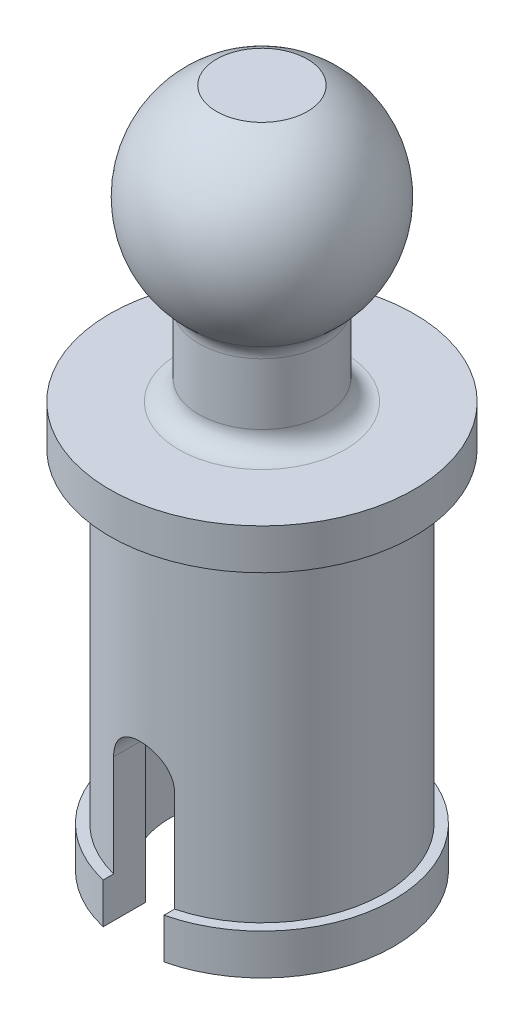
ISO-10303-21;
HEADER;
FILE_DESCRIPTION(('STEP AP214'),'2;1');
FILE_NAME('part.step','',(''),(''),'','','');
FILE_SCHEMA(('AUTOMOTIVE_DESIGN { 1 0 10303 214 1 1 1 1 }'));
ENDSEC;
DATA;
#1=APPLICATION_CONTEXT('core data for automotive mechanical design processes');
#2=APPLICATION_PROTOCOL_DEFINITION('international standard','automotive_design',2000,#1);
#3=PRODUCT_CONTEXT('',#1,'mechanical');
#4=PRODUCT('Part','Part','',(#3));
#5=PRODUCT_RELATED_PRODUCT_CATEGORY('part','',(#4));
#6=PRODUCT_DEFINITION_FORMATION('','',#4);
#7=PRODUCT_DEFINITION_CONTEXT('part definition',#1,'design');
#8=PRODUCT_DEFINITION('design','',#6,#7);
#9=PRODUCT_DEFINITION_SHAPE('','',#8);
#10=(LENGTH_UNIT() NAMED_UNIT(*) SI_UNIT(.MILLI.,.METRE.));
#11=(NAMED_UNIT(*) PLANE_ANGLE_UNIT() SI_UNIT($,.RADIAN.));
#12=(NAMED_UNIT(*) SI_UNIT($,.STERADIAN.) SOLID_ANGLE_UNIT());
#13=UNCERTAINTY_MEASURE_WITH_UNIT(LENGTH_MEASURE(1.E-05),#10,'distance_accuracy_value','');
#14=(GEOMETRIC_REPRESENTATION_CONTEXT(3) GLOBAL_UNCERTAINTY_ASSIGNED_CONTEXT((#13)) GLOBAL_UNIT_ASSIGNED_CONTEXT((#10,
#11,#12)) REPRESENTATION_CONTEXT('',''));
#15=CARTESIAN_POINT('',(0.,0.,0.));
#16=DIRECTION('',(0.,0.,1.));
#17=DIRECTION('',(1.,0.,0.));
#18=AXIS2_PLACEMENT_3D('',#15,#16,#17);
#19=CARTESIAN_POINT('',(-0.6,0.,-3.));
#20=DIRECTION('',(-1.,0.,0.));
#21=DIRECTION('',(0.,-1.,0.));
#22=AXIS2_PLACEMENT_3D('',#19,#20,#21);
#23=PLANE('',#22);
#24=DIRECTION('',(0.,0.,1.));
#25=VECTOR('',#24,1.);
#26=CARTESIAN_POINT('',(-0.6,2.8,-3.));
#27=LINE('',#26,#25);
#28=CARTESIAN_POINT('',(-0.6,2.8,-2.32379000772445));
#29=VERTEX_POINT('',#28);
#30=CARTESIAN_POINT('',(-0.6,2.8,-1.69705627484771));
#31=VERTEX_POINT('',#30);
#32=EDGE_CURVE('E253',#29,#31,#27,.T.);
#33=ORIENTED_EDGE('',*,*,#32,.T.);
#34=DIRECTION('',(0.,-1.,0.));
#35=VECTOR('',#34,1.);
#36=CARTESIAN_POINT('',(-0.599999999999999,7.2,-1.69705627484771));
#37=LINE('',#36,#35);
#38=CARTESIAN_POINT('',(-0.6,0.,-1.69705627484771));
#39=VERTEX_POINT('',#38);
#40=EDGE_CURVE('E235',#31,#39,#37,.T.);
#41=ORIENTED_EDGE('',*,*,#40,.T.);
#42=DIRECTION('',(0.,0.,1.));
#43=VECTOR('',#42,1.);
#44=CARTESIAN_POINT('',(-0.6,0.,-3.));
#45=LINE('',#44,#43);
#46=CARTESIAN_POINT('',(-0.6,0.,-2.5298221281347));
#47=VERTEX_POINT('',#46);
#48=EDGE_CURVE('E155',#47,#39,#45,.T.);
#49=ORIENTED_EDGE('',*,*,#48,.F.);
#50=DIRECTION('',(0.,1.,0.));
#51=VECTOR('',#50,1.);
#52=CARTESIAN_POINT('',(-0.599999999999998,16.8806956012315,-2.5298221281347));
#53=LINE('',#52,#51);
#54=CARTESIAN_POINT('',(-0.6,0.799999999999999,-2.5298221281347));
#55=VERTEX_POINT('',#54);
#56=EDGE_CURVE('E163',#55,#47,#53,.F.);
#57=ORIENTED_EDGE('',*,*,#56,.F.);
#58=DIRECTION('',(0.,0.,-1.));
#59=VECTOR('',#58,1.);
#60=CARTESIAN_POINT('',(-0.6,0.8,0.));
#61=LINE('',#60,#59);
#62=CARTESIAN_POINT('',(-0.599999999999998,0.799999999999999,-2.32379000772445));
#63=VERTEX_POINT('',#62);
#64=EDGE_CURVE('E160',#63,#55,#61,.T.);
#65=ORIENTED_EDGE('',*,*,#64,.F.);
#66=DIRECTION('',(0.,1.,0.));
#67=VECTOR('',#66,1.);
#68=CARTESIAN_POINT('',(-0.599999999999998,16.8806956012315,-2.32379000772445));
#69=LINE('',#68,#67);
#70=EDGE_CURVE('E130',#29,#63,#69,.F.);
#71=ORIENTED_EDGE('',*,*,#70,.F.);
#72=EDGE_LOOP('',(#33,#41,#49,#57,#65,#71));
#73=FACE_BOUND('',#72,.T.);
#74=ADVANCED_FACE('F33',(#73),#23,.F.);
#75=CARTESIAN_POINT('',(0.,2.8,-3.));
#76=DIRECTION('',(0.,0.,1.));
#77=DIRECTION('',(1.,0.,0.));
#78=AXIS2_PLACEMENT_3D('',#75,#76,#77);
#79=CYLINDRICAL_SURFACE('',#78,0.6);
#80=CARTESIAN_POINT('',(-0.6,2.8,1.69705627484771));
#81=VERTEX_POINT('',#80);
#82=CARTESIAN_POINT('',(-0.6,2.8,2.32379000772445));
#83=VERTEX_POINT('',#82);
#84=EDGE_CURVE('E255',#81,#83,#27,.T.);
#85=ORIENTED_EDGE('',*,*,#84,.F.);
#86=CARTESIAN_POINT('',(-0.6,2.8,1.69705627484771));
#87=CARTESIAN_POINT('',(-0.600032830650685,2.83275065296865,1.69701764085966));
#88=CARTESIAN_POINT('',(-0.59732093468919,2.86547046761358,1.69800343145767));
#89=CARTESIAN_POINT('',(-0.586676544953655,2.92984989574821,1.7017244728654));
#90=CARTESIAN_POINT('',(-0.578759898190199,2.96151242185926,1.70445441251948));
#91=CARTESIAN_POINT('',(-0.557977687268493,3.02297120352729,1.71136579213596));
#92=CARTESIAN_POINT('',(-0.545114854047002,3.05276847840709,1.71554643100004));
#93=CARTESIAN_POINT('',(-0.51484322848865,3.10980495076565,1.72487343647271));
#94=CARTESIAN_POINT('',(-0.497431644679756,3.13704256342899,1.73002039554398));
#95=CARTESIAN_POINT('',(-0.457831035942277,3.18923184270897,1.74092668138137));
#96=CARTESIAN_POINT('',(-0.435495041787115,3.21406884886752,1.74670121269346));
#97=CARTESIAN_POINT('',(-0.386993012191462,3.25972369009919,1.75808314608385));
#98=CARTESIAN_POINT('',(-0.360826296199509,3.28054080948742,1.76369051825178));
#99=CARTESIAN_POINT('',(-0.304562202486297,3.31808768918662,1.77428328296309));
#100=CARTESIAN_POINT('',(-0.274380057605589,3.33469658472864,1.77924862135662));
#101=CARTESIAN_POINT('',(-0.211457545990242,3.36255535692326,1.78781765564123));
#102=CARTESIAN_POINT('',(-0.178717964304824,3.37380687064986,1.79142176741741));
#103=CARTESIAN_POINT('',(-0.112817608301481,3.3902414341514,1.79675442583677));
#104=CARTESIAN_POINT('',(-0.0797111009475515,3.39562196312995,1.79854385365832));
#105=CARTESIAN_POINT('',(-0.0130193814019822,3.40078977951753,1.80026165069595));
#106=CARTESIAN_POINT('',(0.0205657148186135,3.40057839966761,1.80019046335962));
#107=CARTESIAN_POINT('',(0.085862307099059,3.3946934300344,1.7982362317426));
#108=CARTESIAN_POINT('',(0.117595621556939,3.38923441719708,1.79642436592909));
#109=CARTESIAN_POINT('',(0.179666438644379,3.37336408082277,1.79128176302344));
#110=CARTESIAN_POINT('',(0.210003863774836,3.36295248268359,1.78795094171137));
#111=CARTESIAN_POINT('',(0.268891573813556,3.33734717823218,1.78005400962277));
#112=CARTESIAN_POINT('',(0.297413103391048,3.3220923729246,1.77547222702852));
#113=CARTESIAN_POINT('',(0.351554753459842,3.28728402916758,1.76555032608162));
#114=CARTESIAN_POINT('',(0.377174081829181,3.26772932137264,1.76021000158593));
#115=CARTESIAN_POINT('',(0.426058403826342,3.22379737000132,1.74903763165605));
#116=CARTESIAN_POINT('',(0.449156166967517,3.19923667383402,1.74319427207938));
#117=CARTESIAN_POINT('',(0.490963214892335,3.14653510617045,1.73188494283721));
#118=CARTESIAN_POINT('',(0.509671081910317,3.1183930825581,1.72641909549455));
#119=CARTESIAN_POINT('',(0.542401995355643,3.05879189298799,1.71642018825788));
#120=CARTESIAN_POINT('',(0.556351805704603,3.02728989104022,1.7119020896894));
#121=CARTESIAN_POINT('',(0.578676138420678,2.96221181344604,1.70448658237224));
#122=CARTESIAN_POINT('',(0.587059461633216,2.92863910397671,1.70158661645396));
#123=CARTESIAN_POINT('',(0.594994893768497,2.87894881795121,1.69881925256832));
#124=CARTESIAN_POINT('',(0.596871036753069,2.86321516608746,1.69816000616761));
#125=CARTESIAN_POINT('',(0.599372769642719,2.83165715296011,1.69727822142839));
#126=CARTESIAN_POINT('',(0.599999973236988,2.81583293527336,1.69705511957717));
#127=CARTESIAN_POINT('',(0.6,2.8,1.69705627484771));
#128=B_SPLINE_CURVE_WITH_KNOTS('',3,(#86,#87,#88,#89,#90,#91,#92,#93,#94,#95,#96,#97,#98,#99,
#100,#101,#102,#103,#104,#105,#106,#107,#108,#109,#110,#111,#112,#113,#114,#115,#116,#117,#118,
#119,#120,#121,#122,#123,#124,#125,#126,#127),.UNSPECIFIED.,.F.,.F.,(4,2,2,2,2,2,2,2,2,2,2,2,2,
2,2,2,2,2,2,2,4),(0.,0.0980770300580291,0.195856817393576,0.293582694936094,0.391368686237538,
0.492607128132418,0.593863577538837,0.69776289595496,0.801630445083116,0.901884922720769,
1.00211550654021,1.09841460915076,1.19471905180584,1.29229021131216,1.38988793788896,
1.49207242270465,1.59428986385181,1.69801627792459,1.80157830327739,1.84910747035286,
1.89657518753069),.UNSPECIFIED.);
#129=CARTESIAN_POINT('',(0.599999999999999,2.8,1.69705627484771));
#130=VERTEX_POINT('',#129);
#131=EDGE_CURVE('E243',#81,#130,#128,.T.);
#132=ORIENTED_EDGE('',*,*,#131,.T.);
#133=DIRECTION('',(0.,0.,1.));
#134=VECTOR('',#133,1.);
#135=CARTESIAN_POINT('',(0.6,2.8,-3.));
#136=LINE('',#135,#134);
#137=CARTESIAN_POINT('',(0.6,2.8,2.32379000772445));
#138=VERTEX_POINT('',#137);
#139=EDGE_CURVE('E146',#130,#138,#136,.T.);
#140=ORIENTED_EDGE('',*,*,#139,.T.);
#141=CARTESIAN_POINT('',(-0.6,2.8,2.32379000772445));
#142=CARTESIAN_POINT('',(-0.600031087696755,2.83319369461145,2.32376171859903));
#143=CARTESIAN_POINT('',(-0.597247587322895,2.86636660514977,2.32450050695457));
#144=CARTESIAN_POINT('',(-0.586295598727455,2.93168786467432,2.3272975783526));
#145=CARTESIAN_POINT('',(-0.57813805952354,2.96383815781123,2.32935317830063));
#146=CARTESIAN_POINT('',(-0.556681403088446,3.02627052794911,2.33457057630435));
#147=CARTESIAN_POINT('',(-0.543382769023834,3.05655278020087,2.33773227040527));
#148=CARTESIAN_POINT('',(-0.512048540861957,3.11446801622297,2.34479533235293));
#149=CARTESIAN_POINT('',(-0.494011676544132,3.14210028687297,2.34869689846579));
#150=CARTESIAN_POINT('',(-0.453290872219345,3.19452601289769,2.35689742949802));
#151=CARTESIAN_POINT('',(-0.430522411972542,3.21925284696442,2.36120270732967));
#152=CARTESIAN_POINT('',(-0.381165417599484,3.26458133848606,2.36967066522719));
#153=CARTESIAN_POINT('',(-0.354576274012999,3.28518233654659,2.37383332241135));
#154=CARTESIAN_POINT('',(-0.297874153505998,3.3219465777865,2.38161708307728));
#155=CARTESIAN_POINT('',(-0.267717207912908,3.3380439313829,2.38522982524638));
#156=CARTESIAN_POINT('',(-0.205021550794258,3.36491484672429,2.39143408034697));
#157=CARTESIAN_POINT('',(-0.172483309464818,3.37568945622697,2.39402579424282));
#158=CARTESIAN_POINT('',(-0.106646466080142,3.39139539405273,2.39785139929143));
#159=CARTESIAN_POINT('',(-0.0733765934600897,3.39644060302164,2.39911171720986));
#160=CARTESIAN_POINT('',(-0.00643966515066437,3.40090202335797,2.40022462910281));
#161=CARTESIAN_POINT('',(0.0272273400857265,3.40031894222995,2.40007740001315));
#162=CARTESIAN_POINT('',(0.0932114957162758,3.39362202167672,2.3984114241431));
#163=CARTESIAN_POINT('',(0.12554202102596,3.38763123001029,2.39692319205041));
#164=CARTESIAN_POINT('',(0.188723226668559,3.37048679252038,2.39277798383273));
#165=CARTESIAN_POINT('',(0.219573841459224,3.35933291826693,2.39012095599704));
#166=CARTESIAN_POINT('',(0.279244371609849,3.33207923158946,2.38388998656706));
#167=CARTESIAN_POINT('',(0.308043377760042,3.31593556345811,2.38030796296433));
#168=CARTESIAN_POINT('',(0.362565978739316,3.27919412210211,2.37261567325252));
#169=CARTESIAN_POINT('',(0.388289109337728,3.25859567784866,2.36850532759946));
#170=CARTESIAN_POINT('',(0.43666163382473,3.2128726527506,2.36007339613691));
#171=CARTESIAN_POINT('',(0.459209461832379,3.18764101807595,2.35574910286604));
#172=CARTESIAN_POINT('',(0.49978174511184,3.13370207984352,2.34747700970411));
#173=CARTESIAN_POINT('',(0.517804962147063,3.10499382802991,2.34352931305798));
#174=CARTESIAN_POINT('',(0.548882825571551,3.0447126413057,2.33644688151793));
#175=CARTESIAN_POINT('',(0.561910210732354,3.01312512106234,2.33331663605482));
#176=CARTESIAN_POINT('',(0.582421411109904,2.94812984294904,2.32828235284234));
#177=CARTESIAN_POINT('',(0.58991351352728,2.9147248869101,2.32637648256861));
#178=CARTESIAN_POINT('',(0.596342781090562,2.86752557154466,2.32473174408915));
#179=CARTESIAN_POINT('',(0.597714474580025,2.85404817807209,2.32437913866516));
#180=CARTESIAN_POINT('',(0.599542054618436,2.82704932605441,2.32390837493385));
#181=CARTESIAN_POINT('',(0.599999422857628,2.81352797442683,2.32378983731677));
#182=CARTESIAN_POINT('',(0.6,2.8,2.32379000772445));
#183=B_SPLINE_CURVE_WITH_KNOTS('',3,(#141,#142,#143,#144,#145,#146,#147,#148,#149,#150,#151,
#152,#153,#154,#155,#156,#157,#158,#159,#160,#161,#162,#163,#164,#165,#166,#167,#168,#169,#170,
#171,#172,#173,#174,#175,#176,#177,#178,#179,#180,#181,#182),.UNSPECIFIED.,.F.,.F.,(4,2,2,2,2,2,
2,2,2,2,2,2,2,2,2,2,2,2,2,2,4),(0.,0.0994244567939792,0.198646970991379,0.297860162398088,
0.397099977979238,0.498294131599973,0.599504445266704,0.702126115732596,0.804727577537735,
0.905251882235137,1.00576355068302,1.10404426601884,1.20232932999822,1.30150404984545,
1.40069371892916,1.50255757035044,1.60444926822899,1.70688931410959,1.8091756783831,
1.84980408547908,1.89036659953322),.UNSPECIFIED.);
#184=EDGE_CURVE('E196',#83,#138,#183,.T.);
#185=ORIENTED_EDGE('',*,*,#184,.F.);
#186=EDGE_LOOP('',(#85,#132,#140,#185));
#187=FACE_BOUND('',#186,.T.);
#188=ADVANCED_FACE('F217',(#187),#79,.F.);
#189=CARTESIAN_POINT('',(0.6,2.8,-3.));
#190=DIRECTION('',(1.,0.,0.));
#191=DIRECTION('',(0.,1.,0.));
#192=AXIS2_PLACEMENT_3D('',#189,#190,#191);
#193=PLANE('',#192);
#194=ORIENTED_EDGE('',*,*,#139,.F.);
#195=DIRECTION('',(0.,-1.,0.));
#196=VECTOR('',#195,1.);
#197=CARTESIAN_POINT('',(0.599999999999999,7.2,1.69705627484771));
#198=LINE('',#197,#196);
#199=CARTESIAN_POINT('',(0.6,0.,1.69705627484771));
#200=VERTEX_POINT('',#199);
#201=EDGE_CURVE('E129',#130,#200,#198,.T.);
#202=ORIENTED_EDGE('',*,*,#201,.T.);
#203=DIRECTION('',(0.,0.,1.));
#204=VECTOR('',#203,1.);
#205=CARTESIAN_POINT('',(0.6,0.,-3.));
#206=LINE('',#205,#204);
#207=CARTESIAN_POINT('',(0.6,0.,2.5298221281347));
#208=VERTEX_POINT('',#207);
#209=EDGE_CURVE('E139',#200,#208,#206,.T.);
#210=ORIENTED_EDGE('',*,*,#209,.T.);
#211=DIRECTION('',(0.,1.,0.));
#212=VECTOR('',#211,1.);
#213=CARTESIAN_POINT('',(0.599999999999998,16.8806956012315,2.5298221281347));
#214=LINE('',#213,#212);
#215=CARTESIAN_POINT('',(0.6,0.799999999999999,2.5298221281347));
#216=VERTEX_POINT('',#215);
#217=EDGE_CURVE('E154',#216,#208,#214,.F.);
#218=ORIENTED_EDGE('',*,*,#217,.F.);
#219=DIRECTION('',(0.,0.,1.));
#220=VECTOR('',#219,1.);
#221=CARTESIAN_POINT('',(0.6,0.8,0.));
#222=LINE('',#221,#220);
#223=CARTESIAN_POINT('',(0.599999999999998,0.799999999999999,2.32379000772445));
#224=VERTEX_POINT('',#223);
#225=EDGE_CURVE('E56',#224,#216,#222,.T.);
#226=ORIENTED_EDGE('',*,*,#225,.F.);
#227=DIRECTION('',(0.,1.,0.));
#228=VECTOR('',#227,1.);
#229=CARTESIAN_POINT('',(0.599999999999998,16.8806956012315,2.32379000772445));
#230=LINE('',#229,#228);
#231=EDGE_CURVE('E194',#138,#224,#230,.F.);
#232=ORIENTED_EDGE('',*,*,#231,.F.);
#233=EDGE_LOOP('',(#194,#202,#210,#218,#226,#232));
#234=FACE_BOUND('',#233,.T.);
#235=ADVANCED_FACE('F318',(#234),#193,.F.);
#236=CARTESIAN_POINT('',(2.6,0.,0.));
#237=DIRECTION('',(0.,1.,0.));
#238=DIRECTION('',(-1.,0.,0.));
#239=AXIS2_PLACEMENT_3D('',#236,#237,#238);
#240=PLANE('',#239);
#241=ORIENTED_EDGE('',*,*,#48,.T.);
#242=CARTESIAN_POINT('',(0.,0.,0.));
#243=DIRECTION('',(0.,-1.,0.));
#244=DIRECTION('',(0.,0.,-1.));
#245=AXIS2_PLACEMENT_3D('',#242,#243,#244);
#246=CIRCLE('',#245,1.8);
#247=CARTESIAN_POINT('',(-0.6,0.,1.69705627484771));
#248=VERTEX_POINT('',#247);
#249=EDGE_CURVE('E141',#248,#39,#246,.T.);
#250=ORIENTED_EDGE('',*,*,#249,.F.);
#251=CARTESIAN_POINT('',(-0.6,0.,2.5298221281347));
#252=VERTEX_POINT('',#251);
#253=EDGE_CURVE('E252',#248,#252,#45,.T.);
#254=ORIENTED_EDGE('',*,*,#253,.T.);
#255=CARTESIAN_POINT('',(0.,0.,0.));
#256=DIRECTION('',(0.,1.,0.));
#257=DIRECTION('',(-1.,0.,0.));
#258=AXIS2_PLACEMENT_3D('',#255,#256,#257);
#259=CIRCLE('',#258,2.6);
#260=EDGE_CURVE('E190',#47,#252,#259,.T.);
#261=ORIENTED_EDGE('',*,*,#260,.F.);
#262=EDGE_LOOP('',(#241,#250,#254,#261));
#263=FACE_BOUND('',#262,.T.);
#264=ADVANCED_FACE('F283',(#263),#240,.F.);
#265=CARTESIAN_POINT('',(0.,16.8806956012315,0.));
#266=DIRECTION('',(0.,1.,0.));
#267=DIRECTION('',(-1.,0.,0.));
#268=AXIS2_PLACEMENT_3D('',#265,#266,#267);
#269=CYLINDRICAL_SURFACE('',#268,2.6);
#270=ORIENTED_EDGE('',*,*,#260,.T.);
#271=DIRECTION('',(0.,1.,0.));
#272=VECTOR('',#271,1.);
#273=CARTESIAN_POINT('',(-0.599999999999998,16.8806956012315,2.5298221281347));
#274=LINE('',#273,#272);
#275=CARTESIAN_POINT('',(-0.6,0.799999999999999,2.5298221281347));
#276=VERTEX_POINT('',#275);
#277=EDGE_CURVE('E167',#252,#276,#274,.T.);
#278=ORIENTED_EDGE('',*,*,#277,.T.);
#279=CARTESIAN_POINT('',(0.,0.799999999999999,0.));
#280=DIRECTION('',(0.,1.,0.));
#281=DIRECTION('',(-1.,0.,0.));
#282=AXIS2_PLACEMENT_3D('',#279,#280,#281);
#283=CIRCLE('',#282,2.6);
#284=EDGE_CURVE('E186',#55,#276,#283,.T.);
#285=ORIENTED_EDGE('',*,*,#284,.F.);
#286=ORIENTED_EDGE('',*,*,#56,.T.);
#287=EDGE_LOOP('',(#270,#278,#285,#286));
#288=FACE_BOUND('',#287,.T.);
#289=ADVANCED_FACE('F279',(#288),#269,.T.);
#290=CARTESIAN_POINT('',(2.4,0.8,0.));
#291=DIRECTION('',(0.,-1.,0.));
#292=DIRECTION('',(1.,0.,0.));
#293=AXIS2_PLACEMENT_3D('',#290,#291,#292);
#294=PLANE('',#293);
#295=ORIENTED_EDGE('',*,*,#284,.T.);
#296=CARTESIAN_POINT('',(-0.599999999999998,0.799999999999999,2.32379000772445));
#297=VERTEX_POINT('',#296);
#298=EDGE_CURVE('E164',#276,#297,#61,.T.);
#299=ORIENTED_EDGE('',*,*,#298,.T.);
#300=CARTESIAN_POINT('',(0.,0.799999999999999,0.));
#301=DIRECTION('',(0.,1.,0.));
#302=DIRECTION('',(-1.,0.,0.));
#303=AXIS2_PLACEMENT_3D('',#300,#301,#302);
#304=CIRCLE('',#303,2.4);
#305=EDGE_CURVE('E182',#63,#297,#304,.T.);
#306=ORIENTED_EDGE('',*,*,#305,.F.);
#307=ORIENTED_EDGE('',*,*,#64,.T.);
#308=EDGE_LOOP('',(#295,#299,#306,#307));
#309=FACE_BOUND('',#308,.T.);
#310=ADVANCED_FACE('F276',(#309),#294,.F.);
#311=ORIENTED_EDGE('',*,*,#209,.F.);
#312=CARTESIAN_POINT('',(0.6,0.,-1.69705627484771));
#313=VERTEX_POINT('',#312);
#314=EDGE_CURVE('E123',#313,#200,#246,.T.);
#315=ORIENTED_EDGE('',*,*,#314,.F.);
#316=CARTESIAN_POINT('',(0.6,0.,-2.5298221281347));
#317=VERTEX_POINT('',#316);
#318=EDGE_CURVE('E137',#317,#313,#206,.T.);
#319=ORIENTED_EDGE('',*,*,#318,.F.);
#320=EDGE_CURVE('E193',#208,#317,#259,.T.);
#321=ORIENTED_EDGE('',*,*,#320,.F.);
#322=EDGE_LOOP('',(#311,#315,#319,#321));
#323=FACE_BOUND('',#322,.T.);
#324=ADVANCED_FACE('F135',(#323),#240,.F.);
#325=ORIENTED_EDGE('',*,*,#320,.T.);
#326=DIRECTION('',(0.,1.,0.));
#327=VECTOR('',#326,1.);
#328=CARTESIAN_POINT('',(0.599999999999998,16.8806956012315,-2.5298221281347));
#329=LINE('',#328,#327);
#330=CARTESIAN_POINT('',(0.6,0.799999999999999,-2.5298221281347));
#331=VERTEX_POINT('',#330);
#332=EDGE_CURVE('E145',#317,#331,#329,.T.);
#333=ORIENTED_EDGE('',*,*,#332,.T.);
#334=EDGE_CURVE('E189',#216,#331,#283,.T.);
#335=ORIENTED_EDGE('',*,*,#334,.F.);
#336=ORIENTED_EDGE('',*,*,#217,.T.);
#337=EDGE_LOOP('',(#325,#333,#335,#336));
#338=FACE_BOUND('',#337,.T.);
#339=ADVANCED_FACE('F329',(#338),#269,.T.);
#340=ORIENTED_EDGE('',*,*,#334,.T.);
#341=CARTESIAN_POINT('',(0.599999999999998,0.799999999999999,-2.32379000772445));
#342=VERTEX_POINT('',#341);
#343=EDGE_CURVE('E156',#331,#342,#222,.T.);
#344=ORIENTED_EDGE('',*,*,#343,.T.);
#345=EDGE_CURVE('E185',#224,#342,#304,.T.);
#346=ORIENTED_EDGE('',*,*,#345,.F.);
#347=ORIENTED_EDGE('',*,*,#225,.T.);
#348=EDGE_LOOP('',(#340,#344,#346,#347));
#349=FACE_BOUND('',#348,.T.);
#350=ADVANCED_FACE('F326',(#349),#294,.F.);
#351=CARTESIAN_POINT('',(0.,16.8806956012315,0.));
#352=DIRECTION('',(0.,1.,0.));
#353=DIRECTION('',(-1.,0.,0.));
#354=AXIS2_PLACEMENT_3D('',#351,#352,#353);
#355=CYLINDRICAL_SURFACE('',#354,2.4);
#356=CARTESIAN_POINT('',(0.,7.2,0.));
#357=DIRECTION('',(0.,1.,0.));
#358=DIRECTION('',(-1.,0.,0.));
#359=AXIS2_PLACEMENT_3D('',#356,#357,#358);
#360=CIRCLE('',#359,2.4);
#361=CARTESIAN_POINT('',(-2.4,7.2,0.));
#362=VERTEX_POINT('',#361);
#363=EDGE_CURVE('E179',#362,#362,#360,.T.);
#364=ORIENTED_EDGE('',*,*,#363,.F.);
#365=EDGE_LOOP('',(#364));
#366=FACE_BOUND('',#365,.T.);
#367=CARTESIAN_POINT('',(0.6,2.8,-2.32379000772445));
#368=CARTESIAN_POINT('',(0.600031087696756,2.83319369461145,-2.32376171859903));
#369=CARTESIAN_POINT('',(0.597247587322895,2.86636660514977,-2.32450050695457));
#370=CARTESIAN_POINT('',(0.586295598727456,2.93168786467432,-2.3272975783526));
#371=CARTESIAN_POINT('',(0.578138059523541,2.96383815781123,-2.32935317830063));
#372=CARTESIAN_POINT('',(0.556681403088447,3.02627052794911,-2.33457057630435));
#373=CARTESIAN_POINT('',(0.543382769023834,3.05655278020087,-2.33773227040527));
#374=CARTESIAN_POINT('',(0.512048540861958,3.11446801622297,-2.34479533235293));
#375=CARTESIAN_POINT('',(0.494011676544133,3.14210028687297,-2.34869689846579));
#376=CARTESIAN_POINT('',(0.453290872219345,3.19452601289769,-2.35689742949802));
#377=CARTESIAN_POINT('',(0.430522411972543,3.21925284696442,-2.36120270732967));
#378=CARTESIAN_POINT('',(0.381165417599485,3.26458133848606,-2.36967066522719));
#379=CARTESIAN_POINT('',(0.354576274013,3.28518233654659,-2.37383332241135));
#380=CARTESIAN_POINT('',(0.297874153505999,3.3219465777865,-2.38161708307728));
#381=CARTESIAN_POINT('',(0.267717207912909,3.3380439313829,-2.38522982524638));
#382=CARTESIAN_POINT('',(0.205021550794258,3.36491484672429,-2.39143408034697));
#383=CARTESIAN_POINT('',(0.172483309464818,3.37568945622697,-2.39402579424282));
#384=CARTESIAN_POINT('',(0.106646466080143,3.39139539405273,-2.39785139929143));
#385=CARTESIAN_POINT('',(0.0733765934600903,3.39644060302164,-2.39911171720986));
#386=CARTESIAN_POINT('',(0.00643966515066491,3.40090202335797,-2.40022462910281));
#387=CARTESIAN_POINT('',(-0.027227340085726,3.40031894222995,-2.40007740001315));
#388=CARTESIAN_POINT('',(-0.0932114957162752,3.39362202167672,-2.3984114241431));
#389=CARTESIAN_POINT('',(-0.125542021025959,3.38763123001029,-2.39692319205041));
#390=CARTESIAN_POINT('',(-0.188723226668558,3.37048679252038,-2.39277798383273));
#391=CARTESIAN_POINT('',(-0.219573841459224,3.35933291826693,-2.39012095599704));
#392=CARTESIAN_POINT('',(-0.279244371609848,3.33207923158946,-2.38388998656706));
#393=CARTESIAN_POINT('',(-0.308043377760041,3.31593556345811,-2.38030796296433));
#394=CARTESIAN_POINT('',(-0.362565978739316,3.27919412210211,-2.37261567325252));
#395=CARTESIAN_POINT('',(-0.388289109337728,3.25859567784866,-2.36850532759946));
#396=CARTESIAN_POINT('',(-0.43666163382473,3.2128726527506,-2.36007339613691));
#397=CARTESIAN_POINT('',(-0.459209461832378,3.18764101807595,-2.35574910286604));
#398=CARTESIAN_POINT('',(-0.49978174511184,3.13370207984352,-2.34747700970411));
#399=CARTESIAN_POINT('',(-0.517804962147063,3.10499382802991,-2.34352931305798));
#400=CARTESIAN_POINT('',(-0.54888282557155,3.0447126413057,-2.33644688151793));
#401=CARTESIAN_POINT('',(-0.561910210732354,3.01312512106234,-2.33331663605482));
#402=CARTESIAN_POINT('',(-0.582421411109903,2.94812984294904,-2.32828235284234));
#403=CARTESIAN_POINT('',(-0.589913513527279,2.9147248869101,-2.32637648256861));
#404=CARTESIAN_POINT('',(-0.596342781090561,2.86752557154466,-2.32473174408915));
#405=CARTESIAN_POINT('',(-0.597714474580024,2.85404817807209,-2.32437913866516));
#406=CARTESIAN_POINT('',(-0.599542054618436,2.82704932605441,-2.32390837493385));
#407=CARTESIAN_POINT('',(-0.599999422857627,2.81352797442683,-2.32378983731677));
#408=CARTESIAN_POINT('',(-0.6,2.8,-2.32379000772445));
#409=B_SPLINE_CURVE_WITH_KNOTS('',3,(#367,#368,#369,#370,#371,#372,#373,#374,#375,#376,#377,
#378,#379,#380,#381,#382,#383,#384,#385,#386,#387,#388,#389,#390,#391,#392,#393,#394,#395,#396,
#397,#398,#399,#400,#401,#402,#403,#404,#405,#406,#407,#408),.UNSPECIFIED.,.F.,.F.,(4,2,2,2,2,2,
2,2,2,2,2,2,2,2,2,2,2,2,2,2,4),(0.,0.0994244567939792,0.198646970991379,0.297860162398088,
0.397099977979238,0.498294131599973,0.599504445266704,0.702126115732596,0.804727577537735,
0.905251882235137,1.00576355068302,1.10404426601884,1.20232932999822,1.30150404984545,
1.40069371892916,1.50255757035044,1.60444926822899,1.70688931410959,1.8091756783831,
1.84980408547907,1.89036659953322),.UNSPECIFIED.);
#410=CARTESIAN_POINT('',(0.6,2.8,-2.32379000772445));
#411=VERTEX_POINT('',#410);
#412=EDGE_CURVE('E225',#411,#29,#409,.T.);
#413=ORIENTED_EDGE('',*,*,#412,.T.);
#414=ORIENTED_EDGE('',*,*,#70,.T.);
#415=ORIENTED_EDGE('',*,*,#305,.T.);
#416=DIRECTION('',(0.,1.,0.));
#417=VECTOR('',#416,1.);
#418=CARTESIAN_POINT('',(-0.599999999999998,16.8806956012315,2.32379000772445));
#419=LINE('',#418,#417);
#420=EDGE_CURVE('E204',#297,#83,#419,.T.);
#421=ORIENTED_EDGE('',*,*,#420,.T.);
#422=ORIENTED_EDGE('',*,*,#184,.T.);
#423=ORIENTED_EDGE('',*,*,#231,.T.);
#424=ORIENTED_EDGE('',*,*,#345,.T.);
#425=DIRECTION('',(0.,1.,0.));
#426=VECTOR('',#425,1.);
#427=CARTESIAN_POINT('',(0.599999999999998,16.8806956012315,-2.32379000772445));
#428=LINE('',#427,#426);
#429=EDGE_CURVE('E264',#342,#411,#428,.T.);
#430=ORIENTED_EDGE('',*,*,#429,.T.);
#431=EDGE_LOOP('',(#413,#414,#415,#421,#422,#423,#424,#430));
#432=FACE_BOUND('',#431,.T.);
#433=ADVANCED_FACE('F206',(#366,#432),#355,.T.);
#434=CARTESIAN_POINT('',(3.,7.2,0.));
#435=DIRECTION('',(0.,1.,0.));
#436=DIRECTION('',(-1.,0.,0.));
#437=AXIS2_PLACEMENT_3D('',#434,#435,#436);
#438=PLANE('',#437);
#439=CARTESIAN_POINT('',(0.,7.2,0.));
#440=DIRECTION('',(0.,1.,0.));
#441=DIRECTION('',(-1.,0.,0.));
#442=AXIS2_PLACEMENT_3D('',#439,#440,#441);
#443=CIRCLE('',#442,3.);
#444=CARTESIAN_POINT('',(-3.,7.2,0.));
#445=VERTEX_POINT('',#444);
#446=EDGE_CURVE('E176',#445,#445,#443,.T.);
#447=ORIENTED_EDGE('',*,*,#446,.F.);
#448=EDGE_LOOP('',(#447));
#449=FACE_BOUND('',#448,.T.);
#450=ORIENTED_EDGE('',*,*,#363,.T.);
#451=EDGE_LOOP('',(#450));
#452=FACE_BOUND('',#451,.T.);
#453=ADVANCED_FACE('F368',(#449,#452),#438,.F.);
#454=CARTESIAN_POINT('',(0.,16.8806956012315,0.));
#455=DIRECTION('',(0.,1.,0.));
#456=DIRECTION('',(-1.,0.,0.));
#457=AXIS2_PLACEMENT_3D('',#454,#455,#456);
#458=CYLINDRICAL_SURFACE('',#457,3.);
#459=CARTESIAN_POINT('',(0.,8.,0.));
#460=DIRECTION('',(0.,1.,0.));
#461=DIRECTION('',(-1.,0.,0.));
#462=AXIS2_PLACEMENT_3D('',#459,#460,#461);
#463=CIRCLE('',#462,3.);
#464=CARTESIAN_POINT('',(-3.,8.,0.));
#465=VERTEX_POINT('',#464);
#466=EDGE_CURVE('E173',#465,#465,#463,.T.);
#467=ORIENTED_EDGE('',*,*,#466,.F.);
#468=EDGE_LOOP('',(#467));
#469=FACE_BOUND('',#468,.T.);
#470=ORIENTED_EDGE('',*,*,#446,.T.);
#471=EDGE_LOOP('',(#470));
#472=FACE_BOUND('',#471,.T.);
#473=ADVANCED_FACE('F401',(#469,#472),#458,.T.);
#474=CARTESIAN_POINT('',(1.24,8.,0.));
#475=DIRECTION('',(0.,-1.,0.));
#476=DIRECTION('',(1.,0.,0.));
#477=AXIS2_PLACEMENT_3D('',#474,#475,#476);
#478=PLANE('',#477);
#479=CARTESIAN_POINT('',(0.,8.,0.));
#480=DIRECTION('',(0.,-1.,0.));
#481=DIRECTION('',(1.,0.,0.));
#482=AXIS2_PLACEMENT_3D('',#479,#480,#481);
#483=CIRCLE('',#482,1.64);
#484=CARTESIAN_POINT('',(1.64,8.,0.));
#485=VERTEX_POINT('',#484);
#486=EDGE_CURVE('E11',#485,#485,#483,.T.);
#487=ORIENTED_EDGE('',*,*,#486,.T.);
#488=EDGE_LOOP('',(#487));
#489=FACE_BOUND('',#488,.T.);
#490=ORIENTED_EDGE('',*,*,#466,.T.);
#491=EDGE_LOOP('',(#490));
#492=FACE_BOUND('',#491,.T.);
#493=ADVANCED_FACE('F406',(#489,#492),#478,.F.);
#494=CARTESIAN_POINT('',(0.,16.8806956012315,0.));
#495=DIRECTION('',(0.,1.,0.));
#496=DIRECTION('',(-1.,0.,0.));
#497=AXIS2_PLACEMENT_3D('',#494,#495,#496);
#498=CYLINDRICAL_SURFACE('',#497,1.24);
#499=CARTESIAN_POINT('',(0.,9.60771481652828,0.));
#500=DIRECTION('',(0.,1.,0.));
#501=DIRECTION('',(-1.,0.,0.));
#502=AXIS2_PLACEMENT_3D('',#499,#500,#501);
#503=CIRCLE('',#502,1.24);
#504=CARTESIAN_POINT('',(-1.24,9.60771481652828,0.));
#505=VERTEX_POINT('',#504);
#506=EDGE_CURVE('E41',#505,#505,#503,.F.);
#507=ORIENTED_EDGE('',*,*,#506,.T.);
#508=EDGE_LOOP('',(#507));
#509=FACE_BOUND('',#508,.T.);
#510=CARTESIAN_POINT('',(0.,8.4,0.));
#511=DIRECTION('',(0.,-1.,0.));
#512=DIRECTION('',(1.,0.,0.));
#513=AXIS2_PLACEMENT_3D('',#510,#511,#512);
#514=CIRCLE('',#513,1.24);
#515=CARTESIAN_POINT('',(1.24,8.4,0.));
#516=VERTEX_POINT('',#515);
#517=EDGE_CURVE('E289',#516,#516,#514,.F.);
#518=ORIENTED_EDGE('',*,*,#517,.T.);
#519=EDGE_LOOP('',(#518));
#520=FACE_BOUND('',#519,.T.);
#521=ADVANCED_FACE('F294',(#509,#520),#498,.T.);
#522=CARTESIAN_POINT('',(0.,11.4976842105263,0.));
#523=DIRECTION('',(0.,1.,0.));
#524=DIRECTION('',(1.,0.,0.));
#525=AXIS2_PLACEMENT_3D('',#522,#523,#524);
#526=SPHERICAL_SURFACE('',#525,2.10231578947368);
#527=CARTESIAN_POINT('',(0.,9.90983006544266,0.));
#528=DIRECTION('',(0.,1.,0.));
#529=DIRECTION('',(-1.,0.,0.));
#530=AXIS2_PLACEMENT_3D('',#527,#528,#529);
#531=CIRCLE('',#530,1.37784284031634);
#532=CARTESIAN_POINT('',(1.37784284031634,9.90983006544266,0.));
#533=VERTEX_POINT('',#532);
#534=EDGE_CURVE('E286',#533,#533,#531,.T.);
#535=CARTESIAN_POINT('',(0.,13.4,0.));
#536=DIRECTION('',(0.,1.,0.));
#537=DIRECTION('',(-1.,0.,0.));
#538=AXIS2_PLACEMENT_3D('',#535,#536,#537);
#539=CIRCLE('',#538,0.894944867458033);
#540=CARTESIAN_POINT('',(0.894944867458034,13.4,0.));
#541=VERTEX_POINT('',#540);
#542=EDGE_CURVE('E170',#541,#541,#539,.T.);
#543=CARTESIAN_POINT('',(1.37784284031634,9.90983006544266,0.));
#544=CARTESIAN_POINT('',(1.41071207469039,9.93834950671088,0.));
#545=CARTESIAN_POINT('',(1.44269320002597,9.96789211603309,0.));
#546=CARTESIAN_POINT('',(1.50476170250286,10.0289039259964,0.));
#547=CARTESIAN_POINT('',(1.53484907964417,10.0603731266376,0.));
#548=CARTESIAN_POINT('',(1.59301255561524,10.1251183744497,0.));
#549=CARTESIAN_POINT('',(1.62108865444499,10.1583944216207,0.));
#550=CARTESIAN_POINT('',(1.67512175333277,10.2266246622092,0.));
#551=CARTESIAN_POINT('',(1.70107875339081,10.2615788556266,0.));
#552=CARTESIAN_POINT('',(1.75077347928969,10.3330307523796,0.));
#553=CARTESIAN_POINT('',(1.77451120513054,10.3695284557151,0.));
#554=CARTESIAN_POINT('',(1.81967590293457,10.4439266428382,0.));
#555=CARTESIAN_POINT('',(1.84110287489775,10.4818271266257,0.));
#556=CARTESIAN_POINT('',(1.88156345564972,10.5588847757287,0.));
#557=CARTESIAN_POINT('',(1.9005970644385,10.5980419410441,0.));
#558=CARTESIAN_POINT('',(1.93619754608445,10.6774619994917,0.));
#559=CARTESIAN_POINT('',(1.95276441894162,10.7177248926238,0.));
#560=CARTESIAN_POINT('',(1.98336756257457,10.7992011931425,0.));
#561=CARTESIAN_POINT('',(1.99740383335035,10.8404146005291,0.));
#562=CARTESIAN_POINT('',(2.02289166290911,10.9236330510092,0.));
#563=CARTESIAN_POINT('',(2.03434322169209,10.9656380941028,0.));
#564=CARTESIAN_POINT('',(2.05461748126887,11.0502778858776,0.));
#565=CARTESIAN_POINT('',(2.06344018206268,11.0929126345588,0.));
#566=CARTESIAN_POINT('',(2.07842271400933,11.1786474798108,0.));
#567=CARTESIAN_POINT('',(2.08458254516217,11.2217475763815,0.));
#568=CARTESIAN_POINT('',(2.09421559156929,11.3082469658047,0.));
#569=CARTESIAN_POINT('',(2.09768880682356,11.3516462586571,0.));
#570=CARTESIAN_POINT('',(2.10193523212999,11.438576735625,0.));
#571=CARTESIAN_POINT('',(2.10270844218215,11.4821079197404,0.));
#572=CARTESIAN_POINT('',(2.10155187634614,11.5691343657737,0.));
#573=CARTESIAN_POINT('',(2.09962210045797,11.6126296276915,0.));
#574=CARTESIAN_POINT('',(2.09306700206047,11.6994165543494,0.));
#575=CARTESIAN_POINT('',(2.08844167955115,11.7427082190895,0.));
#576=CARTESIAN_POINT('',(2.07651331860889,11.8289210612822,0.));
#577=CARTESIAN_POINT('',(2.06921028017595,11.8718422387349,0.));
#578=CARTESIAN_POINT('',(2.05195464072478,11.9571486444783,0.));
#579=CARTESIAN_POINT('',(2.04200203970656,11.999533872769,0.));
#580=CARTESIAN_POINT('',(2.0194856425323,12.0836049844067,0.));
#581=CARTESIAN_POINT('',(2.00692184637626,12.1252908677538,0.));
#582=CARTESIAN_POINT('',(1.97923149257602,12.2078025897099,0.));
#583=CARTESIAN_POINT('',(1.96410493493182,12.2486284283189,0.));
#584=CARTESIAN_POINT('',(1.93134737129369,12.3292626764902,0.));
#585=CARTESIAN_POINT('',(1.91371636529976,12.3690710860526,0.));
#586=CARTESIAN_POINT('',(1.87601787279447,12.4475170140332,0.));
#587=CARTESIAN_POINT('',(1.85595038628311,12.4861545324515,0.));
#588=CARTESIAN_POINT('',(1.81345629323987,12.5621097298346,0.));
#589=CARTESIAN_POINT('',(1.79102968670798,12.5994274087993,0.));
#590=CARTESIAN_POINT('',(1.74390380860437,12.6725990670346,0.));
#591=CARTESIAN_POINT('',(1.71920453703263,12.7084530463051,0.));
#592=CARTESIAN_POINT('',(1.66762854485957,12.7785590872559,0.));
#593=CARTESIAN_POINT('',(1.64075182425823,12.8128111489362,0.));
#594=CARTESIAN_POINT('',(1.58492454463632,12.8795813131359,0.));
#595=CARTESIAN_POINT('',(1.55597398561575,12.9120994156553,0.));
#596=CARTESIAN_POINT('',(1.49611063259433,12.9752763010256,0.));
#597=CARTESIAN_POINT('',(1.4651978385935,13.0059350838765,0.));
#598=CARTESIAN_POINT('',(1.40152919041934,13.0652751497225,0.));
#599=CARTESIAN_POINT('',(1.36877333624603,13.0939564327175,0.));
#600=CARTESIAN_POINT('',(1.30154482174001,13.1492308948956,0.));
#601=CARTESIAN_POINT('',(1.2670721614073,13.1758240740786,0.));
#602=CARTESIAN_POINT('',(1.1965430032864,13.2268199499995,0.));
#603=CARTESIAN_POINT('',(1.1604865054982,13.2512226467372,0.));
#604=CARTESIAN_POINT('',(1.08692838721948,13.2977429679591,0.));
#605=CARTESIAN_POINT('',(1.04942676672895,13.3198605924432,0.));
#606=CARTESIAN_POINT('',(0.973124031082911,13.3617274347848,0.));
#607=CARTESIAN_POINT('',(0.934322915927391,13.3814766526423,0.));
#608=CARTESIAN_POINT('',(0.894944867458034,13.4,0.));
#609=B_SPLINE_CURVE_WITH_KNOTS('',3,(#543,#544,#545,#546,#547,#548,#549,#550,#551,#552,#553,
#554,#555,#556,#557,#558,#559,#560,#561,#562,#563,#564,#565,#566,#567,#568,#569,#570,#571,#572,
#573,#574,#575,#576,#577,#578,#579,#580,#581,#582,#583,#584,#585,#586,#587,#588,#589,#590,#591,
#592,#593,#594,#595,#596,#597,#598,#599,#600,#601,#602,#603,#604,#605,#606,#607,#608),
.UNSPECIFIED.,.F.,.F.,(4,2,2,2,2,2,2,2,2,2,2,2,2,2,2,2,2,2,2,2,2,2,2,2,2,2,2,2,2,2,2,2,4),(0.,
0.130530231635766,0.261060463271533,0.3915906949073,0.522120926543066,0.652651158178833,
0.7831813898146,0.913711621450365,1.04424185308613,1.1747720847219,1.30530231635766,
1.43583254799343,1.5663627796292,1.69689301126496,1.82742324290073,1.9579534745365,
2.08848370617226,2.21901393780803,2.3495441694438,2.48007440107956,2.61060463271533,
2.7411348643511,2.87166509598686,3.00219532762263,3.1327255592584,3.26325579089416,
3.39378602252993,3.5243162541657,3.65484648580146,3.78537671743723,3.915906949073,
4.04643718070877,4.17696741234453),.UNSPECIFIED.);
#610=EDGE_CURVE('BSEAM302',#533,#541,#609,.T.);
#611=ORIENTED_EDGE('',*,*,#534,.T.);
#612=ORIENTED_EDGE('',*,*,#542,.F.);
#613=ORIENTED_EDGE('',*,*,#610,.T.);
#614=ORIENTED_EDGE('',*,*,#610,.F.);
#615=EDGE_LOOP('',(#611,#613,#612,#614));
#616=FACE_BOUND('',#615,.T.);
#617=ADVANCED_FACE('F302',(#616),#526,.T.);
#618=CARTESIAN_POINT('',(0.,13.4,0.));
#619=DIRECTION('',(0.,-1.,0.));
#620=DIRECTION('',(1.,0.,0.));
#621=AXIS2_PLACEMENT_3D('',#618,#619,#620);
#622=PLANE('',#621);
#623=ORIENTED_EDGE('',*,*,#542,.T.);
#624=EDGE_LOOP('',(#623));
#625=FACE_BOUND('',#624,.T.);
#626=ADVANCED_FACE('F305',(#625),#622,.F.);
#627=ORIENTED_EDGE('',*,*,#253,.F.);
#628=DIRECTION('',(0.,-1.,0.));
#629=VECTOR('',#628,1.);
#630=CARTESIAN_POINT('',(-0.599999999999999,7.2,1.69705627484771));
#631=LINE('',#630,#629);
#632=EDGE_CURVE('E150',#248,#81,#631,.F.);
#633=ORIENTED_EDGE('',*,*,#632,.T.);
#634=ORIENTED_EDGE('',*,*,#84,.T.);
#635=ORIENTED_EDGE('',*,*,#420,.F.);
#636=ORIENTED_EDGE('',*,*,#298,.F.);
#637=ORIENTED_EDGE('',*,*,#277,.F.);
#638=EDGE_LOOP('',(#627,#633,#634,#635,#636,#637));
#639=FACE_BOUND('',#638,.T.);
#640=ADVANCED_FACE('F215',(#639),#23,.F.);
#641=CARTESIAN_POINT('',(0.6,2.8,-1.69705627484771));
#642=VERTEX_POINT('',#641);
#643=EDGE_CURVE('E148',#411,#642,#136,.T.);
#644=ORIENTED_EDGE('',*,*,#643,.T.);
#645=CARTESIAN_POINT('',(0.6,2.8,-1.69705627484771));
#646=CARTESIAN_POINT('',(0.600032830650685,2.83275065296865,-1.69701764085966));
#647=CARTESIAN_POINT('',(0.59732093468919,2.86547046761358,-1.69800343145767));
#648=CARTESIAN_POINT('',(0.586676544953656,2.92984989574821,-1.7017244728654));
#649=CARTESIAN_POINT('',(0.5787598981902,2.96151242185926,-1.70445441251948));
#650=CARTESIAN_POINT('',(0.557977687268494,3.02297120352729,-1.71136579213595));
#651=CARTESIAN_POINT('',(0.545114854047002,3.05276847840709,-1.71554643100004));
#652=CARTESIAN_POINT('',(0.514843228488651,3.10980495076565,-1.72487343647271));
#653=CARTESIAN_POINT('',(0.497431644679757,3.13704256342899,-1.73002039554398));
#654=CARTESIAN_POINT('',(0.457831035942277,3.18923184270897,-1.74092668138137));
#655=CARTESIAN_POINT('',(0.435495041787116,3.21406884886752,-1.74670121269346));
#656=CARTESIAN_POINT('',(0.386993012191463,3.25972369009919,-1.75808314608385));
#657=CARTESIAN_POINT('',(0.36082629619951,3.28054080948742,-1.76369051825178));
#658=CARTESIAN_POINT('',(0.304562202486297,3.31808768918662,-1.77428328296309));
#659=CARTESIAN_POINT('',(0.27438005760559,3.33469658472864,-1.77924862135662));
#660=CARTESIAN_POINT('',(0.211457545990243,3.36255535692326,-1.78781765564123));
#661=CARTESIAN_POINT('',(0.178717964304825,3.37380687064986,-1.79142176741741));
#662=CARTESIAN_POINT('',(0.112817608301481,3.3902414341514,-1.79675442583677));
#663=CARTESIAN_POINT('',(0.079711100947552,3.39562196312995,-1.79854385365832));
#664=CARTESIAN_POINT('',(0.0130193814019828,3.40078977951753,-1.80026165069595));
#665=CARTESIAN_POINT('',(-0.0205657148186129,3.40057839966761,-1.80019046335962));
#666=CARTESIAN_POINT('',(-0.0858623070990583,3.3946934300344,-1.7982362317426));
#667=CARTESIAN_POINT('',(-0.117595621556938,3.38923441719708,-1.79642436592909));
#668=CARTESIAN_POINT('',(-0.179666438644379,3.37336408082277,-1.79128176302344));
#669=CARTESIAN_POINT('',(-0.210003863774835,3.36295248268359,-1.78795094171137));
#670=CARTESIAN_POINT('',(-0.268891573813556,3.33734717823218,-1.78005400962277));
#671=CARTESIAN_POINT('',(-0.297413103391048,3.3220923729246,-1.77547222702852));
#672=CARTESIAN_POINT('',(-0.351554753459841,3.28728402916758,-1.76555032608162));
#673=CARTESIAN_POINT('',(-0.37717408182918,3.26772932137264,-1.76021000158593));
#674=CARTESIAN_POINT('',(-0.426058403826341,3.22379737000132,-1.74903763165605));
#675=CARTESIAN_POINT('',(-0.449156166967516,3.19923667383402,-1.74319427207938));
#676=CARTESIAN_POINT('',(-0.490963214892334,3.14653510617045,-1.73188494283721));
#677=CARTESIAN_POINT('',(-0.509671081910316,3.1183930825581,-1.72641909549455));
#678=CARTESIAN_POINT('',(-0.542401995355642,3.05879189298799,-1.71642018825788));
#679=CARTESIAN_POINT('',(-0.556351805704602,3.02728989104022,-1.7119020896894));
#680=CARTESIAN_POINT('',(-0.578676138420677,2.96221181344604,-1.70448658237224));
#681=CARTESIAN_POINT('',(-0.587059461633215,2.92863910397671,-1.70158661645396));
#682=CARTESIAN_POINT('',(-0.594994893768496,2.87894881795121,-1.69881925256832));
#683=CARTESIAN_POINT('',(-0.596871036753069,2.86321516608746,-1.69816000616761));
#684=CARTESIAN_POINT('',(-0.599372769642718,2.83165715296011,-1.69727822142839));
#685=CARTESIAN_POINT('',(-0.599999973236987,2.81583293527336,-1.69705511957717));
#686=CARTESIAN_POINT('',(-0.6,2.8,-1.69705627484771));
#687=B_SPLINE_CURVE_WITH_KNOTS('',3,(#645,#646,#647,#648,#649,#650,#651,#652,#653,#654,#655,
#656,#657,#658,#659,#660,#661,#662,#663,#664,#665,#666,#667,#668,#669,#670,#671,#672,#673,#674,
#675,#676,#677,#678,#679,#680,#681,#682,#683,#684,#685,#686),.UNSPECIFIED.,.F.,.F.,(4,2,2,2,2,2,
2,2,2,2,2,2,2,2,2,2,2,2,2,2,4),(0.,0.0980770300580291,0.195856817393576,0.293582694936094,
0.391368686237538,0.492607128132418,0.593863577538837,0.69776289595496,0.801630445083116,
0.90188492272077,1.00211550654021,1.09841460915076,1.19471905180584,1.29229021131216,
1.38988793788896,1.49207242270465,1.59428986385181,1.69801627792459,1.80157830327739,
1.84910747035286,1.89657518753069),.UNSPECIFIED.);
#688=EDGE_CURVE('E48',#642,#31,#687,.T.);
#689=ORIENTED_EDGE('',*,*,#688,.T.);
#690=ORIENTED_EDGE('',*,*,#32,.F.);
#691=ORIENTED_EDGE('',*,*,#412,.F.);
#692=EDGE_LOOP('',(#644,#689,#690,#691));
#693=FACE_BOUND('',#692,.T.);
#694=ADVANCED_FACE('F210',(#693),#79,.F.);
#695=ORIENTED_EDGE('',*,*,#318,.T.);
#696=DIRECTION('',(0.,-1.,0.));
#697=VECTOR('',#696,1.);
#698=CARTESIAN_POINT('',(0.599999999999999,7.2,-1.69705627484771));
#699=LINE('',#698,#697);
#700=EDGE_CURVE('E120',#313,#642,#699,.F.);
#701=ORIENTED_EDGE('',*,*,#700,.T.);
#702=ORIENTED_EDGE('',*,*,#643,.F.);
#703=ORIENTED_EDGE('',*,*,#429,.F.);
#704=ORIENTED_EDGE('',*,*,#343,.F.);
#705=ORIENTED_EDGE('',*,*,#332,.F.);
#706=EDGE_LOOP('',(#695,#701,#702,#703,#704,#705));
#707=FACE_BOUND('',#706,.T.);
#708=ADVANCED_FACE('F143',(#707),#193,.F.);
#709=CARTESIAN_POINT('',(0.,7.2,0.));
#710=DIRECTION('',(0.,-1.,0.));
#711=DIRECTION('',(0.,0.,-1.));
#712=AXIS2_PLACEMENT_3D('',#709,#710,#711);
#713=CYLINDRICAL_SURFACE('',#712,1.8);
#714=CARTESIAN_POINT('',(0.,7.2,0.));
#715=DIRECTION('',(0.,-1.,0.));
#716=DIRECTION('',(0.,0.,-1.));
#717=AXIS2_PLACEMENT_3D('',#714,#715,#716);
#718=CIRCLE('',#717,1.8);
#719=CARTESIAN_POINT('',(0.,7.2,-1.8));
#720=VERTEX_POINT('',#719);
#721=EDGE_CURVE('E140',#720,#720,#718,.T.);
#722=ORIENTED_EDGE('',*,*,#721,.F.);
#723=EDGE_LOOP('',(#722));
#724=FACE_BOUND('',#723,.T.);
#725=ORIENTED_EDGE('',*,*,#249,.T.);
#726=ORIENTED_EDGE('',*,*,#40,.F.);
#727=ORIENTED_EDGE('',*,*,#688,.F.);
#728=ORIENTED_EDGE('',*,*,#700,.F.);
#729=ORIENTED_EDGE('',*,*,#314,.T.);
#730=ORIENTED_EDGE('',*,*,#201,.F.);
#731=ORIENTED_EDGE('',*,*,#131,.F.);
#732=ORIENTED_EDGE('',*,*,#632,.F.);
#733=EDGE_LOOP('',(#725,#726,#727,#728,#729,#730,#731,#732));
#734=FACE_BOUND('',#733,.T.);
#735=ADVANCED_FACE('F122',(#724,#734),#713,.F.);
#736=CARTESIAN_POINT('',(0.,7.2,0.));
#737=DIRECTION('',(0.,-1.,0.));
#738=DIRECTION('',(0.,0.,-1.));
#739=AXIS2_PLACEMENT_3D('',#736,#737,#738);
#740=PLANE('',#739);
#741=ORIENTED_EDGE('',*,*,#721,.T.);
#742=EDGE_LOOP('',(#741));
#743=FACE_BOUND('',#742,.T.);
#744=ADVANCED_FACE('F240',(#743),#740,.T.);
#745=CARTESIAN_POINT('',(0.,9.60771481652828,0.));
#746=DIRECTION('',(0.,1.,0.));
#747=DIRECTION('',(-1.,0.,0.));
#748=AXIS2_PLACEMENT_3D('',#745,#746,#747);
#749=TOROIDAL_SURFACE('',#748,1.64,0.4);
#750=ORIENTED_EDGE('',*,*,#506,.F.);
#751=EDGE_LOOP('',(#750));
#752=FACE_BOUND('',#751,.T.);
#753=ORIENTED_EDGE('',*,*,#534,.F.);
#754=EDGE_LOOP('',(#753));
#755=FACE_BOUND('',#754,.T.);
#756=ADVANCED_FACE('F297',(#752,#755),#749,.F.);
#757=CARTESIAN_POINT('',(0.,8.4,0.));
#758=DIRECTION('',(0.,-1.,0.));
#759=DIRECTION('',(1.,0.,0.));
#760=AXIS2_PLACEMENT_3D('',#757,#758,#759);
#761=TOROIDAL_SURFACE('',#760,1.64,0.4);
#762=ORIENTED_EDGE('',*,*,#486,.F.);
#763=EDGE_LOOP('',(#762));
#764=FACE_BOUND('',#763,.T.);
#765=ORIENTED_EDGE('',*,*,#517,.F.);
#766=EDGE_LOOP('',(#765));
#767=FACE_BOUND('',#766,.T.);
#768=ADVANCED_FACE('F35',(#764,#767),#761,.F.);
#769=CLOSED_SHELL('',(#74,#188,#235,#264,#289,#310,#324,#339,#350,#433,#453,#473,#493,#521,#617,
#626,#640,#694,#708,#735,#744,#756,#768));
#770=MANIFOLD_SOLID_BREP('B2',#769);
#771=ADVANCED_BREP_SHAPE_REPRESENTATION('',(#18,#770),#14);
#772=SHAPE_DEFINITION_REPRESENTATION(#9,#771);
ENDSEC;
END-ISO-10303-21;
